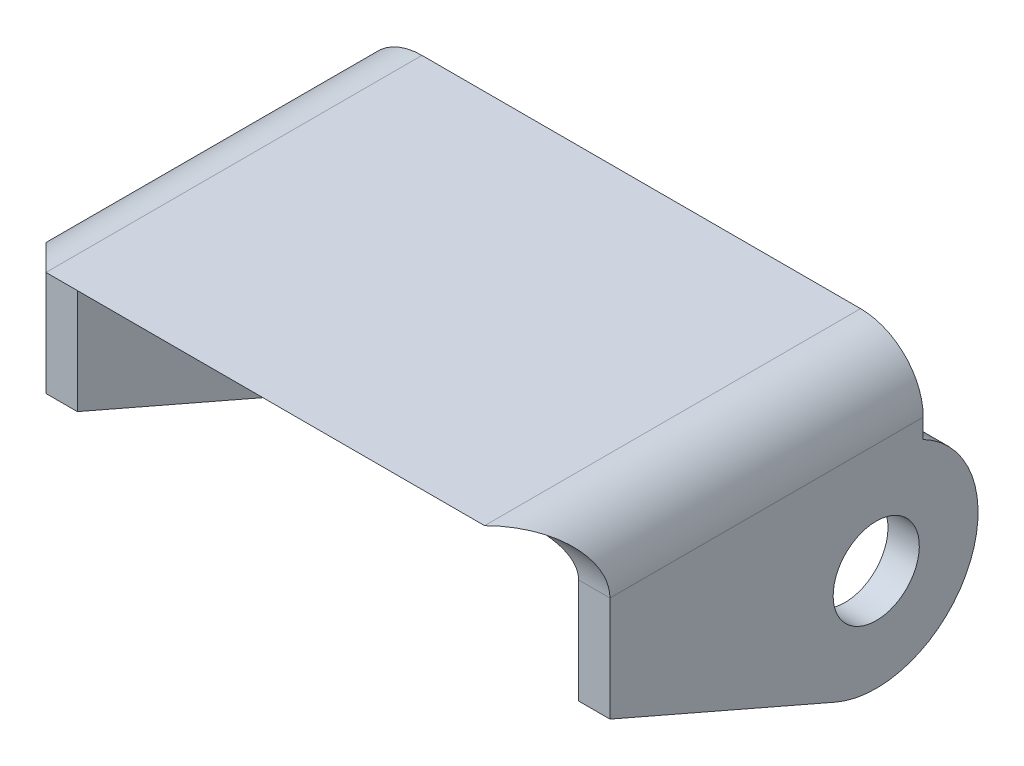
from build123d import *

# Parameters (mm, degrees)
EXTRUDE1_DEPTH = 88.9
SKETCH2_R      = 8.73125
EXTRUDE2_DEPTH = 156.672163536
EXTRUDE3_DEPTH = 156.672163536


with BuildPart() as part:
    # Sketch1 → Extrude1 (new body)
    with BuildSketch(Plane.XY):
        with BuildLine():
            Line((-50.8, -57.15), (-57.15, -57.15))
            Line((-57.15, -57.15), (-57.15, -12.7))
            ThreePointArc((-57.15, -12.7), (-53.430256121, -3.719743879), (-44.45, 0))
            Line((-44.45, 0), (44.45, 0))
            ThreePointArc((44.45, 0), (53.430256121, -3.719743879), (57.15, -12.7))
            Line((57.15, -12.7), (57.15, -57.15))
            Line((57.15, -57.15), (50.8, -57.15))
            Line((50.8, -57.15), (50.8, -12.7))
            ThreePointArc((50.8, -12.7), (48.940128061, -8.209871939), (44.45, -6.35))
            Line((44.45, -6.35), (-44.45, -6.35))
            ThreePointArc((-44.45, -6.35), (-48.940128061, -8.209871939), (-50.8, -12.7))
            Line((-50.8, -12.7), (-50.8, -57.15))
        make_face()
    extrude(amount=EXTRUDE1_DEPTH)

    # Sketch2 → Extrude2 (cut, through all)
    with BuildSketch(Plane(origin=(57.15, 0, 0), x_dir=(0, 0, -1), z_dir=(1, 0, 0))):
        with Locations(Location((-22.225, -34.925, 0), (0, 0, 90))):
            Circle(SKETCH2_R)
    extrude(amount=-EXTRUDE2_DEPTH, mode=Mode.SUBTRACT)

    # Sketch3 → Extrude3 (cut, through all)
    with BuildSketch(Plane(origin=(57.15, 0, 0), x_dir=(0, 0, -1), z_dir=(1, 0, 0))):
        with BuildLine():
            Line((-12.7, 221.370125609), (-12.7, 0))
            Line((-12.7, 0), (-12.7, -16.617056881))
            ThreePointArc((-12.7, -16.617056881), (-3.596843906, -43.807466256), (-30.45418391, -53.850827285))
            Line((-30.45418391, -53.850827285), (-76.2, -33.959980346))
            Line((-76.2, -33.959980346), (-76.2, -12.7))
            ThreePointArc((-76.2, -12.7), (-79.919743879, -3.719743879), (-88.9, 0))
            Line((-88.9, 0), (-310.270125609, 0))
            Line((-310.270125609, 0), (-46.008903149, -355.225191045))
            Line((-46.008903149, -355.225191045), (251.56122246, -133.855065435))
            Line((251.56122246, -133.855065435), (-12.7, 221.370125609))
        make_face()
    extrude(amount=-EXTRUDE3_DEPTH, mode=Mode.SUBTRACT)


solid = part.part
